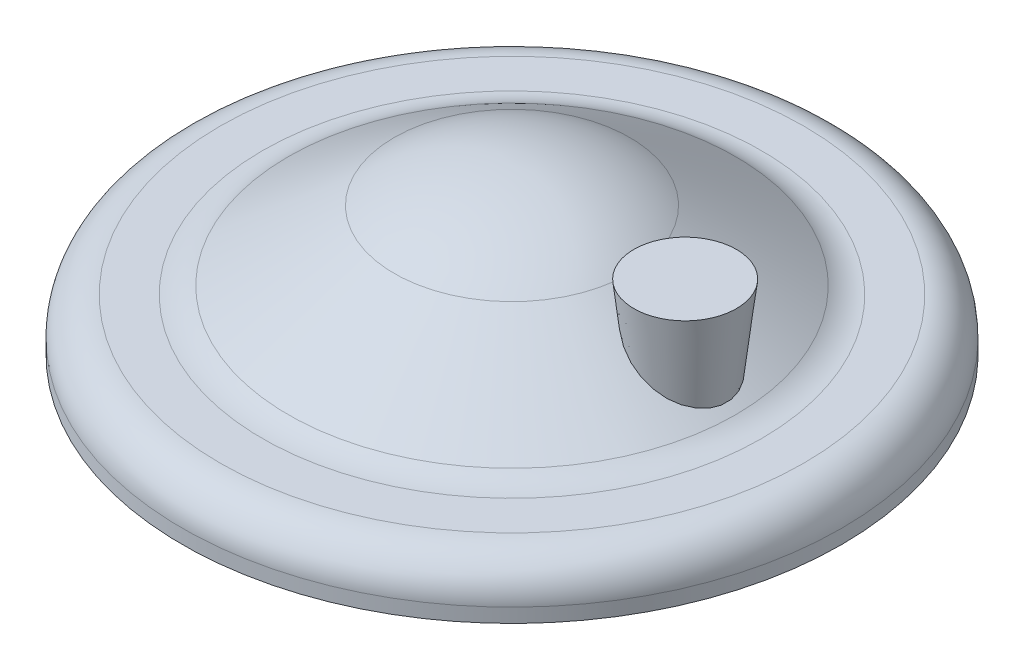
ISO-10303-21;
HEADER;
FILE_DESCRIPTION(('STEP AP214'),'2;1');
FILE_NAME('part.step','',(''),(''),'','','');
FILE_SCHEMA(('AUTOMOTIVE_DESIGN { 1 0 10303 214 1 1 1 1 }'));
ENDSEC;
DATA;
#1=APPLICATION_CONTEXT('core data for automotive mechanical design processes');
#2=APPLICATION_PROTOCOL_DEFINITION('international standard','automotive_design',2000,#1);
#3=PRODUCT_CONTEXT('',#1,'mechanical');
#4=PRODUCT('Part','Part','',(#3));
#5=PRODUCT_RELATED_PRODUCT_CATEGORY('part','',(#4));
#6=PRODUCT_DEFINITION_FORMATION('','',#4);
#7=PRODUCT_DEFINITION_CONTEXT('part definition',#1,'design');
#8=PRODUCT_DEFINITION('design','',#6,#7);
#9=PRODUCT_DEFINITION_SHAPE('','',#8);
#10=(LENGTH_UNIT() NAMED_UNIT(*) SI_UNIT(.MILLI.,.METRE.));
#11=(NAMED_UNIT(*) PLANE_ANGLE_UNIT() SI_UNIT($,.RADIAN.));
#12=(NAMED_UNIT(*) SI_UNIT($,.STERADIAN.) SOLID_ANGLE_UNIT());
#13=UNCERTAINTY_MEASURE_WITH_UNIT(LENGTH_MEASURE(1.E-05),#10,'distance_accuracy_value','');
#14=(GEOMETRIC_REPRESENTATION_CONTEXT(3) GLOBAL_UNCERTAINTY_ASSIGNED_CONTEXT((#13)) GLOBAL_UNIT_ASSIGNED_CONTEXT((#10,
#11,#12)) REPRESENTATION_CONTEXT('',''));
#15=CARTESIAN_POINT('',(0.,0.,0.));
#16=DIRECTION('',(0.,0.,1.));
#17=DIRECTION('',(1.,0.,0.));
#18=AXIS2_PLACEMENT_3D('',#15,#16,#17);
#19=CARTESIAN_POINT('',(46.708025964,26.99973772,0.));
#20=DIRECTION('',(0.,1.,0.));
#21=DIRECTION('',(0.,0.,1.));
#22=AXIS2_PLACEMENT_3D('',#19,#20,#21);
#23=CONICAL_SURFACE('',#22,13.838619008,0.115276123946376);
#24=CARTESIAN_POINT('',(46.708025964,-0.966953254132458,0.));
#25=DIRECTION('',(0.,-1.,0.));
#26=DIRECTION('',(0.,0.,-1.));
#27=AXIS2_PLACEMENT_3D('',#24,#25,#26);
#28=CIRCLE('',#27,10.6003706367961);
#29=CARTESIAN_POINT('',(46.708025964,-0.966953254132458,-10.6003706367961));
#30=VERTEX_POINT('',#29);
#31=EDGE_CURVE('E11',#30,#30,#28,.F.);
#32=ORIENTED_EDGE('',*,*,#31,.T.);
#33=EDGE_LOOP('',(#32));
#34=FACE_BOUND('',#33,.T.);
#35=CARTESIAN_POINT('',(46.708025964,26.99973772,0.));
#36=DIRECTION('',(0.,-1.,0.));
#37=DIRECTION('',(0.,0.,-1.));
#38=AXIS2_PLACEMENT_3D('',#35,#36,#37);
#39=CIRCLE('',#38,13.838619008);
#40=CARTESIAN_POINT('',(46.708025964,26.99973772,-13.838619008));
#41=VERTEX_POINT('',#40);
#42=EDGE_CURVE('E47',#41,#41,#39,.T.);
#43=ORIENTED_EDGE('',*,*,#42,.T.);
#44=EDGE_LOOP('',(#43));
#45=FACE_BOUND('',#44,.T.);
#46=ADVANCED_FACE('F37',(#34,#45),#23,.T.);
#47=CARTESIAN_POINT('',(36.188991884,-1.66940534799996,0.));
#48=DIRECTION('',(0.,1.,0.));
#49=DIRECTION('',(0.,0.,1.));
#50=AXIS2_PLACEMENT_3D('',#47,#48,#49);
#51=PLANE('',#50);
#52=CARTESIAN_POINT('',(46.708025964,-1.66940534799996,0.));
#53=DIRECTION('',(0.,1.,0.));
#54=DIRECTION('',(0.,0.,1.));
#55=AXIS2_PLACEMENT_3D('',#52,#53,#54);
#56=CIRCLE('',#55,9.81188870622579);
#57=CARTESIAN_POINT('',(46.708025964,-1.66940534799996,9.81188870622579));
#58=VERTEX_POINT('',#57);
#59=EDGE_CURVE('E43',#58,#58,#56,.F.);
#60=ORIENTED_EDGE('',*,*,#59,.T.);
#61=EDGE_LOOP('',(#60));
#62=FACE_BOUND('',#61,.T.);
#63=ADVANCED_FACE('F58',(#62),#51,.F.);
#64=CARTESIAN_POINT('',(32.869406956,26.99973772,0.));
#65=DIRECTION('',(0.,-1.,0.));
#66=DIRECTION('',(0.,0.,-1.));
#67=AXIS2_PLACEMENT_3D('',#64,#65,#66);
#68=PLANE('',#67);
#69=ORIENTED_EDGE('',*,*,#42,.F.);
#70=EDGE_LOOP('',(#69));
#71=FACE_BOUND('',#70,.T.);
#72=ADVANCED_FACE('F55',(#71),#68,.F.);
#73=CARTESIAN_POINT('',(46.708025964,-0.875655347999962,0.));
#74=DIRECTION('',(0.,1.,0.));
#75=DIRECTION('',(0.,0.,1.));
#76=AXIS2_PLACEMENT_3D('',#73,#74,#75);
#77=TOROIDAL_SURFACE('',#76,9.81188870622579,0.79375);
#78=ORIENTED_EDGE('',*,*,#31,.F.);
#79=EDGE_LOOP('',(#78));
#80=FACE_BOUND('',#79,.T.);
#81=ORIENTED_EDGE('',*,*,#59,.F.);
#82=EDGE_LOOP('',(#81));
#83=FACE_BOUND('',#82,.T.);
#84=ADVANCED_FACE('F57',(#80,#83),#77,.T.);
#85=CLOSED_SHELL('',(#46,#63,#72,#84));
#86=MANIFOLD_SOLID_BREP('B2',#85);
#87=CARTESIAN_POINT('',(0.,-27.5882494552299,0.));
#88=DIRECTION('',(0.,1.,0.));
#89=DIRECTION('',(1.,0.,0.));
#90=AXIS2_PLACEMENT_3D('',#87,#88,#89);
#91=SPHERICAL_SURFACE('',#90,51.5614492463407);
#92=CARTESIAN_POINT('',(0.,15.5146216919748,0.));
#93=DIRECTION('',(0.,1.,0.));
#94=DIRECTION('',(-1.,0.,0.));
#95=AXIS2_PLACEMENT_3D('',#92,#93,#94);
#96=CIRCLE('',#95,28.2970943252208);
#97=CARTESIAN_POINT('',(-28.2970943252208,15.5146216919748,0.));
#98=VERTEX_POINT('',#97);
#99=EDGE_CURVE('E133',#98,#98,#96,.T.);
#100=ORIENTED_EDGE('',*,*,#99,.F.);
#101=EDGE_LOOP('',(#100));
#102=FACE_BOUND('',#101,.T.);
#103=ADVANCED_FACE('F93',(#102),#91,.F.);
#104=CARTESIAN_POINT('',(0.,-27.5882494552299,0.));
#105=DIRECTION('',(0.,1.,0.));
#106=DIRECTION('',(1.,0.,0.));
#107=AXIS2_PLACEMENT_3D('',#104,#105,#106);
#108=SPHERICAL_SURFACE('',#107,57.9114492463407);
#109=CARTESIAN_POINT('',(0.,20.8229137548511,0.));
#110=DIRECTION('',(0.,1.,0.));
#111=DIRECTION('',(-1.,0.,0.));
#112=AXIS2_PLACEMENT_3D('',#109,#110,#111);
#113=CIRCLE('',#112,31.7819953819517);
#114=CARTESIAN_POINT('',(-31.7819953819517,20.8229137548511,0.));
#115=VERTEX_POINT('',#114);
#116=EDGE_CURVE('E36',#115,#115,#113,.T.);
#117=ORIENTED_EDGE('',*,*,#116,.T.);
#118=EDGE_LOOP('',(#117));
#119=FACE_BOUND('',#118,.T.);
#120=ADVANCED_FACE('F141',(#119),#108,.T.);
#121=CARTESIAN_POINT('',(0.,2.08341587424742,0.));
#122=DIRECTION('',(0.,-1.,0.));
#123=DIRECTION('',(1.,0.,0.));
#124=AXIS2_PLACEMENT_3D('',#121,#122,#123);
#125=CONICAL_SURFACE('',#124,60.32648667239,0.989864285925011);
#126=ORIENTED_EDGE('',*,*,#116,.F.);
#127=EDGE_LOOP('',(#126));
#128=FACE_BOUND('',#127,.T.);
#129=CARTESIAN_POINT('',(0.,2.08341587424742,0.));
#130=DIRECTION('',(0.,1.,0.));
#131=DIRECTION('',(-1.,0.,0.));
#132=AXIS2_PLACEMENT_3D('',#129,#130,#131);
#133=CIRCLE('',#132,60.32648667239);
#134=CARTESIAN_POINT('',(-60.32648667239,2.08341587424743,0.));
#135=VERTEX_POINT('',#134);
#136=EDGE_CURVE('E99',#135,#135,#133,.T.);
#137=ORIENTED_EDGE('',*,*,#136,.T.);
#138=EDGE_LOOP('',(#137));
#139=FACE_BOUND('',#138,.T.);
#140=ADVANCED_FACE('F145',(#128,#139),#125,.T.);
#141=CARTESIAN_POINT('',(0.,12.7,0.));
#142=DIRECTION('',(0.,1.,0.));
#143=DIRECTION('',(-1.,0.,0.));
#144=AXIS2_PLACEMENT_3D('',#141,#142,#143);
#145=TOROIDAL_SURFACE('',#144,67.2962887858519,12.7);
#146=ORIENTED_EDGE('',*,*,#136,.F.);
#147=EDGE_LOOP('',(#146));
#148=FACE_BOUND('',#147,.T.);
#149=CARTESIAN_POINT('',(0.,0.,0.));
#150=DIRECTION('',(0.,1.,0.));
#151=DIRECTION('',(-1.,0.,0.));
#152=AXIS2_PLACEMENT_3D('',#149,#150,#151);
#153=CIRCLE('',#152,67.2962887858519);
#154=CARTESIAN_POINT('',(-67.2962887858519,0.,0.));
#155=VERTEX_POINT('',#154);
#156=EDGE_CURVE('E103',#155,#155,#153,.T.);
#157=ORIENTED_EDGE('',*,*,#156,.T.);
#158=EDGE_LOOP('',(#157));
#159=FACE_BOUND('',#158,.T.);
#160=ADVANCED_FACE('F149',(#148,#159),#145,.F.);
#161=CARTESIAN_POINT('',(78.74,0.,0.));
#162=DIRECTION('',(0.,-1.,0.));
#163=DIRECTION('',(1.,0.,0.));
#164=AXIS2_PLACEMENT_3D('',#161,#162,#163);
#165=PLANE('',#164);
#166=ORIENTED_EDGE('',*,*,#156,.F.);
#167=EDGE_LOOP('',(#166));
#168=FACE_BOUND('',#167,.T.);
#169=CARTESIAN_POINT('',(0.,0.,0.));
#170=DIRECTION('',(0.,1.,0.));
#171=DIRECTION('',(-1.,0.,0.));
#172=AXIS2_PLACEMENT_3D('',#169,#170,#171);
#173=CIRCLE('',#172,78.74);
#174=CARTESIAN_POINT('',(-78.74,0.,0.));
#175=VERTEX_POINT('',#174);
#176=EDGE_CURVE('E107',#175,#175,#173,.T.);
#177=ORIENTED_EDGE('',*,*,#176,.T.);
#178=EDGE_LOOP('',(#177));
#179=FACE_BOUND('',#178,.T.);
#180=ADVANCED_FACE('F155',(#168,#179),#165,.F.);
#181=CARTESIAN_POINT('',(0.,-10.16,0.));
#182=DIRECTION('',(0.,1.,0.));
#183=DIRECTION('',(-1.,0.,0.));
#184=AXIS2_PLACEMENT_3D('',#181,#182,#183);
#185=TOROIDAL_SURFACE('',#184,78.74,10.16);
#186=ORIENTED_EDGE('',*,*,#176,.F.);
#187=EDGE_LOOP('',(#186));
#188=FACE_BOUND('',#187,.T.);
#189=CARTESIAN_POINT('',(0.,-10.16,0.));
#190=DIRECTION('',(0.,1.,0.));
#191=DIRECTION('',(-1.,0.,0.));
#192=AXIS2_PLACEMENT_3D('',#189,#190,#191);
#193=CIRCLE('',#192,88.9);
#194=CARTESIAN_POINT('',(-88.9,-10.16,0.));
#195=VERTEX_POINT('',#194);
#196=EDGE_CURVE('E112',#195,#195,#193,.T.);
#197=ORIENTED_EDGE('',*,*,#196,.T.);
#198=EDGE_LOOP('',(#197));
#199=FACE_BOUND('',#198,.T.);
#200=ADVANCED_FACE('F159',(#188,#199),#185,.T.);
#201=CARTESIAN_POINT('',(0.,30.3231997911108,0.));
#202=DIRECTION('',(0.,1.,0.));
#203=DIRECTION('',(-1.,0.,0.));
#204=AXIS2_PLACEMENT_3D('',#201,#202,#203);
#205=CYLINDRICAL_SURFACE('',#204,88.9);
#206=ORIENTED_EDGE('',*,*,#196,.F.);
#207=EDGE_LOOP('',(#206));
#208=FACE_BOUND('',#207,.T.);
#209=CARTESIAN_POINT('',(0.,-13.97,0.));
#210=DIRECTION('',(0.,1.,0.));
#211=DIRECTION('',(-1.,0.,0.));
#212=AXIS2_PLACEMENT_3D('',#209,#210,#211);
#213=CIRCLE('',#212,88.9);
#214=CARTESIAN_POINT('',(-88.9,-13.97,0.));
#215=VERTEX_POINT('',#214);
#216=EDGE_CURVE('E115',#215,#215,#213,.T.);
#217=ORIENTED_EDGE('',*,*,#216,.T.);
#218=EDGE_LOOP('',(#217));
#219=FACE_BOUND('',#218,.T.);
#220=ADVANCED_FACE('F163',(#208,#219),#205,.T.);
#221=CARTESIAN_POINT('',(82.55,-13.97,0.));
#222=DIRECTION('',(0.,1.,0.));
#223=DIRECTION('',(-1.,0.,0.));
#224=AXIS2_PLACEMENT_3D('',#221,#222,#223);
#225=PLANE('',#224);
#226=ORIENTED_EDGE('',*,*,#216,.F.);
#227=EDGE_LOOP('',(#226));
#228=FACE_BOUND('',#227,.T.);
#229=CARTESIAN_POINT('',(0.,-13.97,0.));
#230=DIRECTION('',(0.,1.,0.));
#231=DIRECTION('',(-1.,0.,0.));
#232=AXIS2_PLACEMENT_3D('',#229,#230,#231);
#233=CIRCLE('',#232,82.55);
#234=CARTESIAN_POINT('',(-82.55,-13.9699999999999,0.));
#235=VERTEX_POINT('',#234);
#236=EDGE_CURVE('E118',#235,#235,#233,.T.);
#237=ORIENTED_EDGE('',*,*,#236,.T.);
#238=EDGE_LOOP('',(#237));
#239=FACE_BOUND('',#238,.T.);
#240=ADVANCED_FACE('F167',(#228,#239),#225,.F.);
#241=CARTESIAN_POINT('',(0.,30.3231997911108,0.));
#242=DIRECTION('',(0.,1.,0.));
#243=DIRECTION('',(-1.,0.,0.));
#244=AXIS2_PLACEMENT_3D('',#241,#242,#243);
#245=CYLINDRICAL_SURFACE('',#244,82.55);
#246=CARTESIAN_POINT('',(0.,-10.16,0.));
#247=DIRECTION('',(0.,1.,0.));
#248=DIRECTION('',(-1.,0.,0.));
#249=AXIS2_PLACEMENT_3D('',#246,#247,#248);
#250=CIRCLE('',#249,82.55);
#251=CARTESIAN_POINT('',(-82.55,-10.16,0.));
#252=VERTEX_POINT('',#251);
#253=EDGE_CURVE('E121',#252,#252,#250,.T.);
#254=ORIENTED_EDGE('',*,*,#253,.T.);
#255=EDGE_LOOP('',(#254));
#256=FACE_BOUND('',#255,.T.);
#257=ORIENTED_EDGE('',*,*,#236,.F.);
#258=EDGE_LOOP('',(#257));
#259=FACE_BOUND('',#258,.T.);
#260=ADVANCED_FACE('F171',(#256,#259),#245,.F.);
#261=CARTESIAN_POINT('',(0.,-10.16,0.));
#262=DIRECTION('',(0.,1.,0.));
#263=DIRECTION('',(-1.,0.,0.));
#264=AXIS2_PLACEMENT_3D('',#261,#262,#263);
#265=TOROIDAL_SURFACE('',#264,78.74,3.81000000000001);
#266=CARTESIAN_POINT('',(0.,-6.34999999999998,0.));
#267=DIRECTION('',(0.,1.,0.));
#268=DIRECTION('',(-1.,0.,0.));
#269=AXIS2_PLACEMENT_3D('',#266,#267,#268);
#270=CIRCLE('',#269,78.74);
#271=CARTESIAN_POINT('',(-78.74,-6.34999999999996,0.));
#272=VERTEX_POINT('',#271);
#273=EDGE_CURVE('E124',#272,#272,#270,.T.);
#274=ORIENTED_EDGE('',*,*,#273,.T.);
#275=EDGE_LOOP('',(#274));
#276=FACE_BOUND('',#275,.T.);
#277=ORIENTED_EDGE('',*,*,#253,.F.);
#278=EDGE_LOOP('',(#277));
#279=FACE_BOUND('',#278,.T.);
#280=ADVANCED_FACE('F175',(#276,#279),#265,.F.);
#281=CARTESIAN_POINT('',(78.74,-6.35,0.));
#282=DIRECTION('',(0.,-1.,0.));
#283=DIRECTION('',(1.,0.,0.));
#284=AXIS2_PLACEMENT_3D('',#281,#282,#283);
#285=PLANE('',#284);
#286=CARTESIAN_POINT('',(0.,-6.34999999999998,0.));
#287=DIRECTION('',(0.,1.,0.));
#288=DIRECTION('',(-1.,0.,0.));
#289=AXIS2_PLACEMENT_3D('',#286,#287,#288);
#290=CIRCLE('',#289,67.2962887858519);
#291=CARTESIAN_POINT('',(-67.2962887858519,-6.34999999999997,0.));
#292=VERTEX_POINT('',#291);
#293=EDGE_CURVE('E127',#292,#292,#290,.T.);
#294=ORIENTED_EDGE('',*,*,#293,.T.);
#295=EDGE_LOOP('',(#294));
#296=FACE_BOUND('',#295,.T.);
#297=ORIENTED_EDGE('',*,*,#273,.F.);
#298=EDGE_LOOP('',(#297));
#299=FACE_BOUND('',#298,.T.);
#300=ADVANCED_FACE('F179',(#296,#299),#285,.T.);
#301=CARTESIAN_POINT('',(0.,12.7,0.));
#302=DIRECTION('',(0.,1.,0.));
#303=DIRECTION('',(-1.,0.,0.));
#304=AXIS2_PLACEMENT_3D('',#301,#302,#303);
#305=TOROIDAL_SURFACE('',#304,67.2962887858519,19.05);
#306=CARTESIAN_POINT('',(0.,-3.22487618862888,0.));
#307=DIRECTION('',(0.,1.,0.));
#308=DIRECTION('',(-1.,0.,0.));
#309=AXIS2_PLACEMENT_3D('',#306,#307,#308);
#310=CIRCLE('',#309,56.841585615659);
#311=CARTESIAN_POINT('',(-56.841585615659,-3.22487618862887,0.));
#312=VERTEX_POINT('',#311);
#313=EDGE_CURVE('E130',#312,#312,#310,.T.);
#314=ORIENTED_EDGE('',*,*,#313,.T.);
#315=EDGE_LOOP('',(#314));
#316=FACE_BOUND('',#315,.T.);
#317=ORIENTED_EDGE('',*,*,#293,.F.);
#318=EDGE_LOOP('',(#317));
#319=FACE_BOUND('',#318,.T.);
#320=ADVANCED_FACE('F183',(#316,#319),#305,.T.);
#321=CARTESIAN_POINT('',(0.,-3.22487618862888,0.));
#322=DIRECTION('',(0.,-1.,0.));
#323=DIRECTION('',(1.,0.,0.));
#324=AXIS2_PLACEMENT_3D('',#321,#322,#323);
#325=CONICAL_SURFACE('',#324,56.841585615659,0.989864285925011);
#326=ORIENTED_EDGE('',*,*,#99,.T.);
#327=EDGE_LOOP('',(#326));
#328=FACE_BOUND('',#327,.T.);
#329=ORIENTED_EDGE('',*,*,#313,.F.);
#330=EDGE_LOOP('',(#329));
#331=FACE_BOUND('',#330,.T.);
#332=ADVANCED_FACE('F137',(#328,#331),#325,.F.);
#333=CLOSED_SHELL('',(#103,#120,#140,#160,#180,#200,#220,#240,#260,#280,#300,#320,#332));
#334=MANIFOLD_SOLID_BREP('B6',#333);
#335=ADVANCED_BREP_SHAPE_REPRESENTATION('',(#18,#86,#334),#14);
#336=SHAPE_DEFINITION_REPRESENTATION(#9,#335);
ENDSEC;
END-ISO-10303-21;
